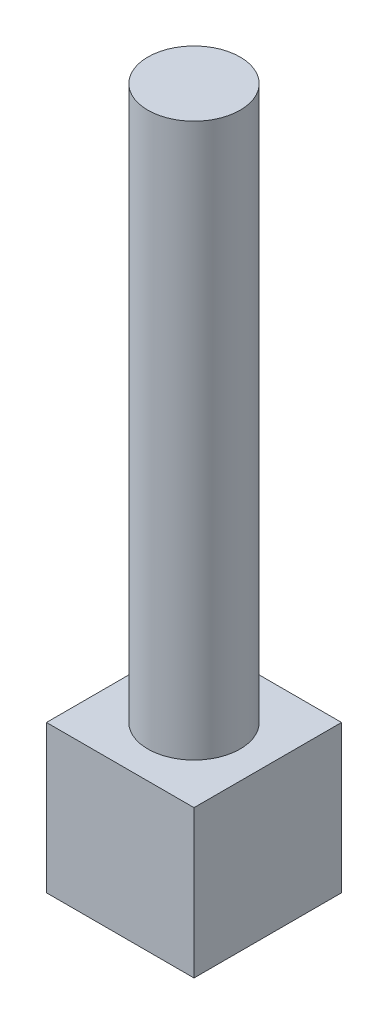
ISO-10303-21;
HEADER;
FILE_DESCRIPTION(('STEP AP214'),'2;1');
FILE_NAME('part.step','',(''),(''),'','','');
FILE_SCHEMA(('AUTOMOTIVE_DESIGN { 1 0 10303 214 1 1 1 1 }'));
ENDSEC;
DATA;
#1=APPLICATION_CONTEXT('core data for automotive mechanical design processes');
#2=APPLICATION_PROTOCOL_DEFINITION('international standard','automotive_design',2000,#1);
#3=PRODUCT_CONTEXT('',#1,'mechanical');
#4=PRODUCT('Part','Part','',(#3));
#5=PRODUCT_RELATED_PRODUCT_CATEGORY('part','',(#4));
#6=PRODUCT_DEFINITION_FORMATION('','',#4);
#7=PRODUCT_DEFINITION_CONTEXT('part definition',#1,'design');
#8=PRODUCT_DEFINITION('design','',#6,#7);
#9=PRODUCT_DEFINITION_SHAPE('','',#8);
#10=(LENGTH_UNIT() NAMED_UNIT(*) SI_UNIT(.MILLI.,.METRE.));
#11=(NAMED_UNIT(*) PLANE_ANGLE_UNIT() SI_UNIT($,.RADIAN.));
#12=(NAMED_UNIT(*) SI_UNIT($,.STERADIAN.) SOLID_ANGLE_UNIT());
#13=UNCERTAINTY_MEASURE_WITH_UNIT(LENGTH_MEASURE(1.E-05),#10,'distance_accuracy_value','');
#14=(GEOMETRIC_REPRESENTATION_CONTEXT(3) GLOBAL_UNCERTAINTY_ASSIGNED_CONTEXT((#13)) GLOBAL_UNIT_ASSIGNED_CONTEXT((#10,
#11,#12)) REPRESENTATION_CONTEXT('',''));
#15=CARTESIAN_POINT('',(0.,0.,0.));
#16=DIRECTION('',(0.,0.,1.));
#17=DIRECTION('',(1.,0.,0.));
#18=AXIS2_PLACEMENT_3D('',#15,#16,#17);
#19=CARTESIAN_POINT('',(0.,40.,40.));
#20=DIRECTION('',(0.,-1.,0.));
#21=DIRECTION('',(0.,0.,-1.));
#22=AXIS2_PLACEMENT_3D('',#19,#20,#21);
#23=PLANE('',#22);
#24=DIRECTION('',(-1.,0.,0.));
#25=VECTOR('',#24,1.);
#26=CARTESIAN_POINT('',(0.,40.,0.));
#27=LINE('',#26,#25);
#28=CARTESIAN_POINT('',(40.,40.,0.));
#29=VERTEX_POINT('',#28);
#30=CARTESIAN_POINT('',(0.,40.,0.));
#31=VERTEX_POINT('',#30);
#32=EDGE_CURVE('E82',#29,#31,#27,.T.);
#33=ORIENTED_EDGE('',*,*,#32,.T.);
#34=DIRECTION('',(0.,0.,-1.));
#35=VECTOR('',#34,1.);
#36=CARTESIAN_POINT('',(0.,40.,40.));
#37=LINE('',#36,#35);
#38=CARTESIAN_POINT('',(0.,40.,40.));
#39=VERTEX_POINT('',#38);
#40=EDGE_CURVE('E105',#39,#31,#37,.T.);
#41=ORIENTED_EDGE('',*,*,#40,.F.);
#42=DIRECTION('',(-1.,0.,0.));
#43=VECTOR('',#42,1.);
#44=CARTESIAN_POINT('',(0.,40.,40.));
#45=LINE('',#44,#43);
#46=CARTESIAN_POINT('',(40.,40.,40.));
#47=VERTEX_POINT('',#46);
#48=EDGE_CURVE('E59',#47,#39,#45,.T.);
#49=ORIENTED_EDGE('',*,*,#48,.F.);
#50=DIRECTION('',(0.,0.,-1.));
#51=VECTOR('',#50,1.);
#52=CARTESIAN_POINT('',(40.,40.,40.));
#53=LINE('',#52,#51);
#54=EDGE_CURVE('E101',#47,#29,#53,.T.);
#55=ORIENTED_EDGE('',*,*,#54,.T.);
#56=EDGE_LOOP('',(#33,#41,#49,#55));
#57=FACE_BOUND('',#56,.T.);
#58=CARTESIAN_POINT('',(20.,40.,20.));
#59=DIRECTION('',(0.,-1.,0.));
#60=DIRECTION('',(0.,0.,-1.));
#61=AXIS2_PLACEMENT_3D('',#58,#59,#60);
#62=CIRCLE('',#61,12.5);
#63=CARTESIAN_POINT('',(20.,40.,7.5));
#64=VERTEX_POINT('',#63);
#65=EDGE_CURVE('E13',#64,#64,#62,.F.);
#66=ORIENTED_EDGE('',*,*,#65,.F.);
#67=EDGE_LOOP('',(#66));
#68=FACE_BOUND('',#67,.T.);
#69=ADVANCED_FACE('F42',(#57,#68),#23,.F.);
#70=CARTESIAN_POINT('',(0.,0.,40.));
#71=DIRECTION('',(1.,0.,0.));
#72=DIRECTION('',(0.,0.,-1.));
#73=AXIS2_PLACEMENT_3D('',#70,#71,#72);
#74=PLANE('',#73);
#75=DIRECTION('',(0.,-1.,0.));
#76=VECTOR('',#75,1.);
#77=CARTESIAN_POINT('',(0.,0.,0.));
#78=LINE('',#77,#76);
#79=CARTESIAN_POINT('',(0.,0.,0.));
#80=VERTEX_POINT('',#79);
#81=EDGE_CURVE('E109',#31,#80,#78,.T.);
#82=ORIENTED_EDGE('',*,*,#81,.T.);
#83=DIRECTION('',(0.,0.,-1.));
#84=VECTOR('',#83,1.);
#85=CARTESIAN_POINT('',(0.,0.,40.));
#86=LINE('',#85,#84);
#87=CARTESIAN_POINT('',(0.,0.,40.));
#88=VERTEX_POINT('',#87);
#89=EDGE_CURVE('E51',#88,#80,#86,.T.);
#90=ORIENTED_EDGE('',*,*,#89,.F.);
#91=DIRECTION('',(0.,-1.,0.));
#92=VECTOR('',#91,1.);
#93=CARTESIAN_POINT('',(0.,0.,40.));
#94=LINE('',#93,#92);
#95=EDGE_CURVE('E95',#39,#88,#94,.T.);
#96=ORIENTED_EDGE('',*,*,#95,.F.);
#97=ORIENTED_EDGE('',*,*,#40,.T.);
#98=EDGE_LOOP('',(#82,#90,#96,#97));
#99=FACE_BOUND('',#98,.T.);
#100=ADVANCED_FACE('F44',(#99),#74,.F.);
#101=CARTESIAN_POINT('',(0.,0.,40.));
#102=DIRECTION('',(0.,1.,0.));
#103=DIRECTION('',(0.,0.,1.));
#104=AXIS2_PLACEMENT_3D('',#101,#102,#103);
#105=PLANE('',#104);
#106=DIRECTION('',(1.,0.,0.));
#107=VECTOR('',#106,1.);
#108=CARTESIAN_POINT('',(0.,0.,0.));
#109=LINE('',#108,#107);
#110=CARTESIAN_POINT('',(40.,0.,0.));
#111=VERTEX_POINT('',#110);
#112=EDGE_CURVE('E100',#80,#111,#109,.T.);
#113=ORIENTED_EDGE('',*,*,#112,.T.);
#114=DIRECTION('',(0.,0.,-1.));
#115=VECTOR('',#114,1.);
#116=CARTESIAN_POINT('',(40.,0.,40.));
#117=LINE('',#116,#115);
#118=CARTESIAN_POINT('',(40.,0.,40.));
#119=VERTEX_POINT('',#118);
#120=EDGE_CURVE('E98',#119,#111,#117,.T.);
#121=ORIENTED_EDGE('',*,*,#120,.F.);
#122=DIRECTION('',(1.,0.,0.));
#123=VECTOR('',#122,1.);
#124=CARTESIAN_POINT('',(0.,0.,40.));
#125=LINE('',#124,#123);
#126=EDGE_CURVE('E90',#88,#119,#125,.T.);
#127=ORIENTED_EDGE('',*,*,#126,.F.);
#128=ORIENTED_EDGE('',*,*,#89,.T.);
#129=EDGE_LOOP('',(#113,#121,#127,#128));
#130=FACE_BOUND('',#129,.T.);
#131=ADVANCED_FACE('F99',(#130),#105,.F.);
#132=CARTESIAN_POINT('',(40.,0.,40.));
#133=DIRECTION('',(-1.,0.,0.));
#134=DIRECTION('',(0.,0.,1.));
#135=AXIS2_PLACEMENT_3D('',#132,#133,#134);
#136=PLANE('',#135);
#137=DIRECTION('',(0.,1.,0.));
#138=VECTOR('',#137,1.);
#139=CARTESIAN_POINT('',(40.,0.,0.));
#140=LINE('',#139,#138);
#141=EDGE_CURVE('E76',#111,#29,#140,.T.);
#142=ORIENTED_EDGE('',*,*,#141,.T.);
#143=ORIENTED_EDGE('',*,*,#54,.F.);
#144=DIRECTION('',(0.,1.,0.));
#145=VECTOR('',#144,1.);
#146=CARTESIAN_POINT('',(40.,0.,40.));
#147=LINE('',#146,#145);
#148=EDGE_CURVE('E93',#119,#47,#147,.T.);
#149=ORIENTED_EDGE('',*,*,#148,.F.);
#150=ORIENTED_EDGE('',*,*,#120,.T.);
#151=EDGE_LOOP('',(#142,#143,#149,#150));
#152=FACE_BOUND('',#151,.T.);
#153=ADVANCED_FACE('F103',(#152),#136,.F.);
#154=CARTESIAN_POINT('',(0.,40.,40.));
#155=DIRECTION('',(0.,0.,-1.));
#156=DIRECTION('',(-1.,0.,0.));
#157=AXIS2_PLACEMENT_3D('',#154,#155,#156);
#158=PLANE('',#157);
#159=ORIENTED_EDGE('',*,*,#95,.T.);
#160=ORIENTED_EDGE('',*,*,#126,.T.);
#161=ORIENTED_EDGE('',*,*,#148,.T.);
#162=ORIENTED_EDGE('',*,*,#48,.T.);
#163=EDGE_LOOP('',(#159,#160,#161,#162));
#164=FACE_BOUND('',#163,.T.);
#165=ADVANCED_FACE('F91',(#164),#158,.F.);
#166=CARTESIAN_POINT('',(0.,40.,0.));
#167=DIRECTION('',(0.,0.,-1.));
#168=DIRECTION('',(-1.,0.,0.));
#169=AXIS2_PLACEMENT_3D('',#166,#167,#168);
#170=PLANE('',#169);
#171=ORIENTED_EDGE('',*,*,#81,.F.);
#172=ORIENTED_EDGE('',*,*,#32,.F.);
#173=ORIENTED_EDGE('',*,*,#141,.F.);
#174=ORIENTED_EDGE('',*,*,#112,.F.);
#175=EDGE_LOOP('',(#171,#172,#173,#174));
#176=FACE_BOUND('',#175,.T.);
#177=ADVANCED_FACE('F120',(#176),#170,.T.);
#178=CARTESIAN_POINT('',(20.,190.,20.));
#179=DIRECTION('',(0.,-1.,0.));
#180=DIRECTION('',(0.,0.,-1.));
#181=AXIS2_PLACEMENT_3D('',#178,#179,#180);
#182=CYLINDRICAL_SURFACE('',#181,12.5);
#183=CARTESIAN_POINT('',(20.,190.,20.));
#184=DIRECTION('',(0.,1.,0.));
#185=DIRECTION('',(0.,0.,1.));
#186=AXIS2_PLACEMENT_3D('',#183,#184,#185);
#187=CIRCLE('',#186,12.5);
#188=CARTESIAN_POINT('',(20.,190.,32.5));
#189=VERTEX_POINT('',#188);
#190=EDGE_CURVE('E112',#189,#189,#187,.T.);
#191=ORIENTED_EDGE('',*,*,#190,.F.);
#192=EDGE_LOOP('',(#191));
#193=FACE_BOUND('',#192,.T.);
#194=ORIENTED_EDGE('',*,*,#65,.T.);
#195=EDGE_LOOP('',(#194));
#196=FACE_BOUND('',#195,.T.);
#197=ADVANCED_FACE('F122',(#193,#196),#182,.T.);
#198=CARTESIAN_POINT('',(20.,190.,20.));
#199=DIRECTION('',(0.,1.,0.));
#200=DIRECTION('',(0.,0.,1.));
#201=AXIS2_PLACEMENT_3D('',#198,#199,#200);
#202=PLANE('',#201);
#203=ORIENTED_EDGE('',*,*,#190,.T.);
#204=EDGE_LOOP('',(#203));
#205=FACE_BOUND('',#204,.T.);
#206=ADVANCED_FACE('F128',(#205),#202,.T.);
#207=CLOSED_SHELL('',(#69,#100,#131,#153,#165,#177,#197,#206));
#208=MANIFOLD_SOLID_BREP('B2',#207);
#209=ADVANCED_BREP_SHAPE_REPRESENTATION('',(#18,#208),#14);
#210=SHAPE_DEFINITION_REPRESENTATION(#9,#209);
ENDSEC;
END-ISO-10303-21;
